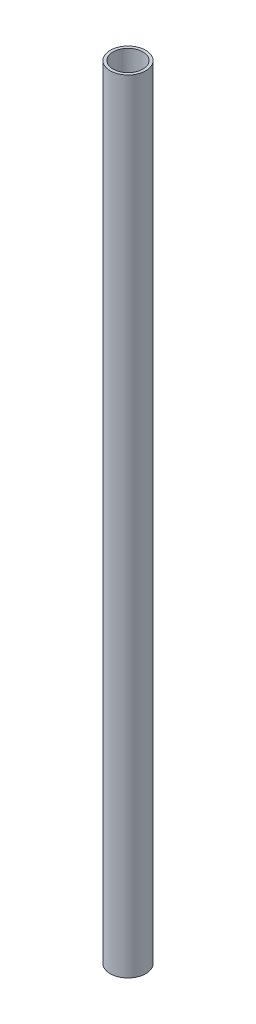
from build123d import *

# Parameters (mm, degrees)
SKETCH1_R           = 12.5
SKETCH1_R_2         = 10.5
BOSS_EXTRUDE1_DEPTH = 550


with BuildPart() as part:
    # Sketch1 → Boss-Extrude1 (new body)
    with BuildSketch(Plane(origin=(0, 0, 0), x_dir=(1, 0, 0), z_dir=(0, 1, 0))):
        with Locations(Location((0, 0, 0), (0, 0, 270))):
            Circle(SKETCH1_R)
        with Locations(Location((0, 0, 0), (0, 0, 270))):
            Circle(SKETCH1_R_2, mode=Mode.SUBTRACT)
    extrude(amount=BOSS_EXTRUDE1_DEPTH)


solid = part.part
